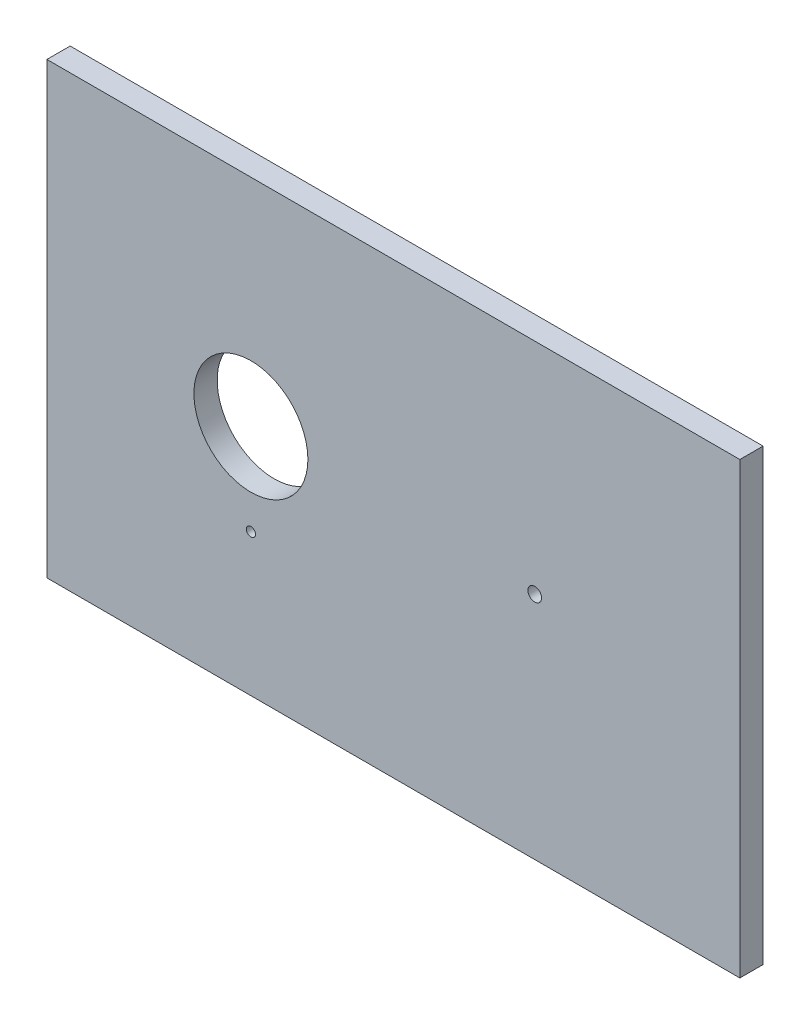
from build123d import *

# Parameters (mm, degrees)
ESQUISSE1_W             = 304
ESQUISSE1_H             = 197
BOSS_EXTRU_1_DEPTH      = 5.1
ESQUISSE2_R             = 25
ESQUISSE2_R_2           = 3
ENL_V_MAT_EXTRU_1_DEPTH = 35
ESQUISSE3_R             = 2
ENL_V_MAT_EXTRU_2_DEPTH = 241.831565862


with BuildPart() as part:
    # Esquisse1 → Boss.-Extru.1 (new, symmetric)
    with BuildSketch(Plane.XY):
        Rectangle(ESQUISSE1_W, ESQUISSE1_H)
    extrude(amount=BOSS_EXTRU_1_DEPTH, both=True)

    # Esquisse2 → Enl_v. mat.-Extru.1 (cut)
    with BuildSketch(Plane(origin=(41.286720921, -41.036542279, 24.1), x_dir=(1, 0, 0), z_dir=(0, 0, 1))):
        with Locations((-103.791407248, 44.835959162)):
            Circle(ESQUISSE2_R)
        with Locations((20.719325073, 43.382280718)):
            Circle(ESQUISSE2_R_2)
    extrude(amount=-ENL_V_MAT_EXTRU_1_DEPTH, mode=Mode.SUBTRACT)

    # Esquisse3 → Enl_v. mat.-Extru.2 (cut, through all)
    with BuildSketch(Plane(origin=(41.286720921, -41.036542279, 29.1), x_dir=(1, 0, 0), z_dir=(0, 0, 1))):
        with Locations((-103.791407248, 4.835959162)):
            Circle(ESQUISSE3_R)
    extrude(amount=-ENL_V_MAT_EXTRU_2_DEPTH, mode=Mode.SUBTRACT)


solid = part.part
